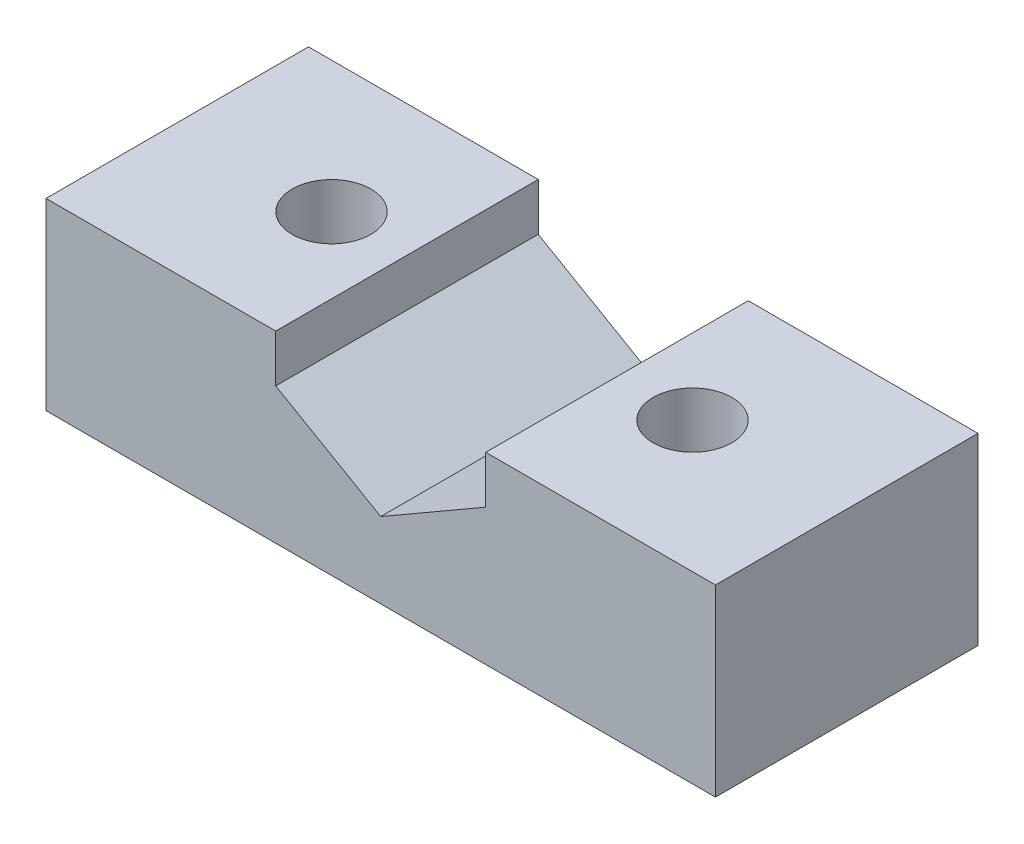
from build123d import *

# Parameters (mm, degrees)
SKETCH1_W           = 25.5
SKETCH1_H           = 10
BOSS_EXTRUDE1_DEPTH = 7
CUT_EXTRUDE1_DEPTH  = 18.651133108
SKETCH3_R           = 1.5
CUT_EXTRUDE2_DEPTH  = 16.380588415


with BuildPart() as part:
    # Sketch1 → Boss-Extrude1 (new body)
    with BuildSketch(Plane(origin=(0, 0, 0), x_dir=(1, 0, 0), z_dir=(0, 1, 0))):
        Rectangle(SKETCH1_W, SKETCH1_H)
    extrude(amount=BOSS_EXTRUDE1_DEPTH)

    # Sketch2 → Cut-Extrude1 (cut, through all)
    with BuildSketch(Plane.XY.offset(5)):
        Polygon((4, 5.190598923), (4, 9.809401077), (0, 12.118802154), (-4, 9.809401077), (-4, 5.190598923), (0, 2.881197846), align=None)
    extrude(amount=-CUT_EXTRUDE1_DEPTH, mode=Mode.SUBTRACT)

    # Sketch3 → Cut-Extrude2 (cut, through all)
    with BuildSketch(Plane(origin=(0, 7, 0), x_dir=(1, 0, 0), z_dir=(0, 1, 0))):
        with Locations(Location((-6.875, 0, 0), (0, 0, 270))):
            Circle(SKETCH3_R)
    cut_extrude2 = extrude(amount=-CUT_EXTRUDE2_DEPTH, mode=Mode.SUBTRACT)

    # Mirror1: Cut-Extrude2 across plane
    add(cut_extrude2.mirror(Plane(origin=(0, 0, 0), x_dir=(0, 0, 1), z_dir=(1, 0, 0))), mode=Mode.SUBTRACT)


solid = part.part
